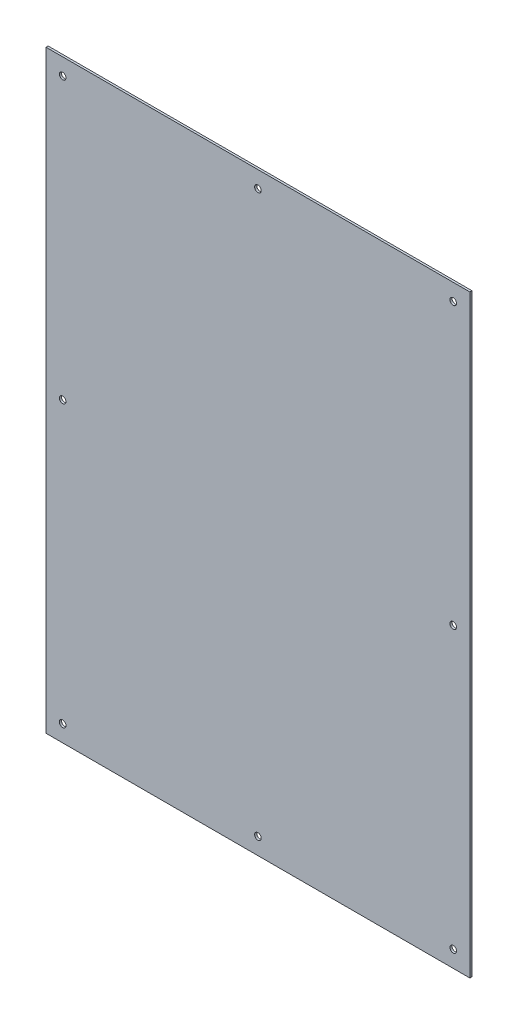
from build123d import *

# Parameters (mm, degrees)
SKETCH1_W               = 647.7
SKETCH1_H               = 908.05
EXTRUDE1_DEPTH          = 3.2512
F_3_8_CLEARANCE_HOLE1_D = 10.0838


with BuildPart() as part:
    # Sketch1 → Extrude1 (new body)
    with BuildSketch(Plane.XY):
        with Locations((149.225, 0)):
            Rectangle(SKETCH1_W, SKETCH1_H)
    extrude(amount=EXTRUDE1_DEPTH)

    # 3_8 Clearance Hole1 (through all)
    with Locations(Plane.XY.offset(3.2512)):
        with Locations((-149.225, 428.625), (-149.225, 0), (-149.225, -428.625), (149.225, -428.625), (447.675, -428.625), (447.675, 0), (447.675, 428.625), (149.225, 428.625)):
            Hole(F_3_8_CLEARANCE_HOLE1_D / 2)


solid = part.part
